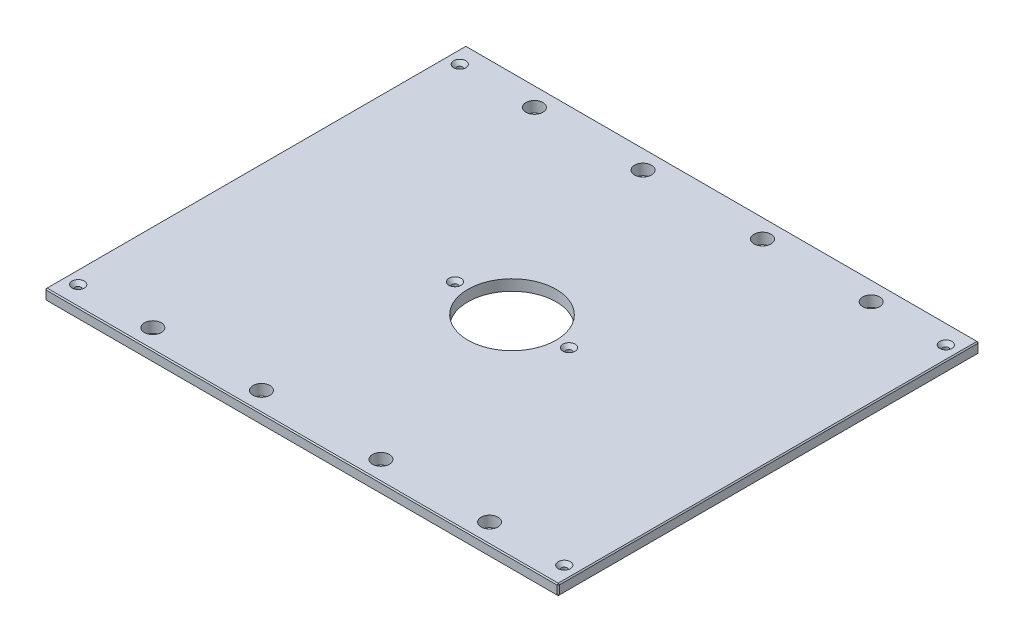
from build123d import *

# Parameters (mm, degrees)
SKETCH1_W                                        = 600.075
SKETCH1_H                                        = 492.125
BOSS_EXTRUDE1_DEPTH                              = 12.7
SKETCH13_R                                       = 51.562
CUT_EXTRUDE6_DEPTH                               = 389.24031902
F_25_32_0_78125_DIAMETER_HOLE1_D                 = 19.84375
CHAMFER2_SIZE                                    = 1.27
CSK_FOR_1_4_FLAT_HEAD_MACHINE_SCREW1_D           = 6.7564
CSK_FOR_1_4_FLAT_HEAD_MACHINE_SCREW1_CSINK_D     = 14.2748
CSK_FOR_1_4_FLAT_HEAD_MACHINE_SCREW1_CSINK_ANGLE = 82


with BuildPart() as part:
    # Sketch1 → Boss-Extrude1 (new body)
    with BuildSketch(Plane(origin=(0, 0, 0), x_dir=(1, 0, 0), z_dir=(0, 1, 0))):
        Rectangle(SKETCH1_W, SKETCH1_H)
    extrude(amount=BOSS_EXTRUDE1_DEPTH)

    # Sketch13 → Cut-Extrude6 (cut, through all)
    with BuildSketch(Plane(origin=(0, 12.7, 0), x_dir=(1, 0, 0), z_dir=(0, 1, 0))):
        with Locations(Location((0, 0, 0), (0, 0, 270))):
            Circle(SKETCH13_R)
    extrude(amount=-CUT_EXTRUDE6_DEPTH, mode=Mode.SUBTRACT)

    # 25_32 _0.78125_ Diameter Hole1 (through all)
    with Locations(Plane(origin=(0, 12.7, 0), x_dir=(1, 0, 0), z_dir=(0, 1, 0))):
        with Locations((196.85, 223.04248), (-196.85, 223.04248), (196.85, -223.04248), (-196.85, -223.04248), (-69.85, 223.04248), (69.85, 223.04248), (69.85, -223.04248), (-69.85, -223.04248)):
            Hole(F_25_32_0_78125_DIAMETER_HOLE1_D / 2)

    # Chamfer2
    chamfer2_edges = [part.edges().sort_by_distance(p)[0] for p in [
        (300.0375, 12.7, 0),
        (0, 12.7, -246.0625),
        (-300.0375, 12.7, 0),
        (0, 0, -246.0625),
        (300.0375, 0, 0),
        (0, 0, 246.0625),
        (-300.0375, 0, 0),
        (0, 12.7, 246.0625),
        (-300.0375, 6.35, -246.0625),
        (300.0375, 6.35, -246.0625),
        (300.0375, 6.35, 246.0625),
        (-300.0375, 6.35, 246.0625),
    ]]
    chamfer(chamfer2_edges, length=CHAMFER2_SIZE)

    # CSK for 1_4 Flat Head Machine Screw1 (through all)
    with Locations(Plane(origin=(0, 12.7, 0), x_dir=(1, 0, 0), z_dir=(0, 1, 0))):
        with Locations((284.1625, 223.04248), (284.1625, -223.04248), (-284.1625, -223.04248), (-66.675, 0), (66.675, 0), (-284.1625, 223.04248), (-196.85, 223.04248), (-196.85, -223.04248)):
            CounterSinkHole(CSK_FOR_1_4_FLAT_HEAD_MACHINE_SCREW1_D / 2, CSK_FOR_1_4_FLAT_HEAD_MACHINE_SCREW1_CSINK_D / 2, counter_sink_angle=CSK_FOR_1_4_FLAT_HEAD_MACHINE_SCREW1_CSINK_ANGLE)


solid = part.part
